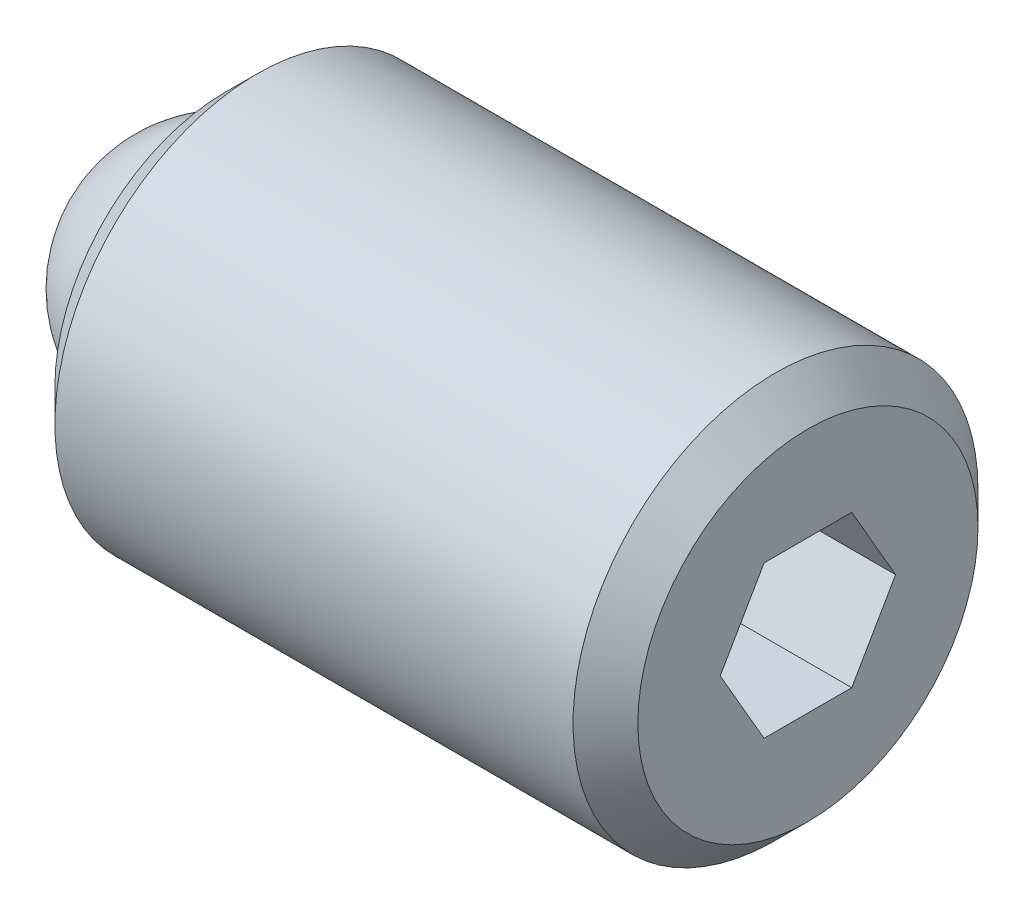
ISO-10303-21;
HEADER;
FILE_DESCRIPTION(('STEP AP214'),'2;1');
FILE_NAME('part.step','',(''),(''),'','','');
FILE_SCHEMA(('AUTOMOTIVE_DESIGN { 1 0 10303 214 1 1 1 1 }'));
ENDSEC;
DATA;
#1=APPLICATION_CONTEXT('core data for automotive mechanical design processes');
#2=APPLICATION_PROTOCOL_DEFINITION('international standard','automotive_design',2000,#1);
#3=PRODUCT_CONTEXT('',#1,'mechanical');
#4=PRODUCT('Part','Part','',(#3));
#5=PRODUCT_RELATED_PRODUCT_CATEGORY('part','',(#4));
#6=PRODUCT_DEFINITION_FORMATION('','',#4);
#7=PRODUCT_DEFINITION_CONTEXT('part definition',#1,'design');
#8=PRODUCT_DEFINITION('design','',#6,#7);
#9=PRODUCT_DEFINITION_SHAPE('','',#8);
#10=(LENGTH_UNIT() NAMED_UNIT(*) SI_UNIT(.MILLI.,.METRE.));
#11=(NAMED_UNIT(*) PLANE_ANGLE_UNIT() SI_UNIT($,.RADIAN.));
#12=(NAMED_UNIT(*) SI_UNIT($,.STERADIAN.) SOLID_ANGLE_UNIT());
#13=UNCERTAINTY_MEASURE_WITH_UNIT(LENGTH_MEASURE(1.E-05),#10,'distance_accuracy_value','');
#14=(GEOMETRIC_REPRESENTATION_CONTEXT(3) GLOBAL_UNCERTAINTY_ASSIGNED_CONTEXT((#13)) GLOBAL_UNIT_ASSIGNED_CONTEXT((#10,
#11,#12)) REPRESENTATION_CONTEXT('',''));
#15=CARTESIAN_POINT('',(0.,0.,0.));
#16=DIRECTION('',(0.,0.,1.));
#17=DIRECTION('',(1.,0.,0.));
#18=AXIS2_PLACEMENT_3D('',#15,#16,#17);
#19=CARTESIAN_POINT('',(0.,0.,0.));
#20=DIRECTION('',(0.,-1.,0.));
#21=DIRECTION('',(0.,0.,1.));
#22=AXIS2_PLACEMENT_3D('',#19,#20,#21);
#23=SPHERICAL_SURFACE('',#22,1.984375);
#24=CARTESIAN_POINT('',(0.,-1.984375,0.));
#25=VERTEX_POINT('',#24);
#26=VERTEX_LOOP('',#25);
#27=FACE_BOUND('',#26,.T.);
#28=ADVANCED_FACE('F43',(#27),#23,.T.);
#29=CLOSED_SHELL('',(#28));
#30=MANIFOLD_SOLID_BREP('B2',#29);
#31=CARTESIAN_POINT('',(9.140825,0.,0.));
#32=DIRECTION('',(-1.,0.,0.));
#33=DIRECTION('',(0.,0.,1.));
#34=AXIS2_PLACEMENT_3D('',#31,#32,#33);
#35=CYLINDRICAL_SURFACE('',#34,3.175);
#36=CARTESIAN_POINT('',(8.632825,0.,0.));
#37=DIRECTION('',(1.,0.,0.));
#38=DIRECTION('',(0.,0.,-1.));
#39=AXIS2_PLACEMENT_3D('',#36,#37,#38);
#40=CIRCLE('',#39,3.175);
#41=CARTESIAN_POINT('',(8.632825,0.,-3.175));
#42=VERTEX_POINT('',#41);
#43=EDGE_CURVE('E41',#42,#42,#40,.F.);
#44=ORIENTED_EDGE('',*,*,#43,.T.);
#45=EDGE_LOOP('',(#44));
#46=FACE_BOUND('',#45,.T.);
#47=CARTESIAN_POINT('',(0.507999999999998,0.,0.));
#48=DIRECTION('',(1.,0.,0.));
#49=DIRECTION('',(0.,0.,-1.));
#50=AXIS2_PLACEMENT_3D('',#47,#48,#49);
#51=CIRCLE('',#50,3.175);
#52=CARTESIAN_POINT('',(0.507999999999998,0.,-3.175));
#53=VERTEX_POINT('',#52);
#54=EDGE_CURVE('E159',#53,#53,#51,.T.);
#55=ORIENTED_EDGE('',*,*,#54,.T.);
#56=EDGE_LOOP('',(#55));
#57=FACE_BOUND('',#56,.T.);
#58=ADVANCED_FACE('F56',(#46,#57),#35,.T.);
#59=CARTESIAN_POINT('',(9.140825,0.,0.));
#60=DIRECTION('',(1.,0.,0.));
#61=DIRECTION('',(0.,0.,-1.));
#62=AXIS2_PLACEMENT_3D('',#59,#60,#61);
#63=PLANE('',#62);
#64=DIRECTION('',(0.,0.866025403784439,-0.5));
#65=VECTOR('',#64,1.);
#66=CARTESIAN_POINT('',(9.140825,-1.190625,-0.687407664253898));
#67=LINE('',#66,#65);
#68=CARTESIAN_POINT('',(9.140825,-1.190625,-0.687407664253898));
#69=VERTEX_POINT('',#68);
#70=CARTESIAN_POINT('',(9.140825,0.,-1.3748153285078));
#71=VERTEX_POINT('',#70);
#72=EDGE_CURVE('E71',#69,#71,#67,.T.);
#73=ORIENTED_EDGE('',*,*,#72,.F.);
#74=DIRECTION('',(0.,0.,-1.));
#75=VECTOR('',#74,1.);
#76=CARTESIAN_POINT('',(9.140825,-1.190625,0.687407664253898));
#77=LINE('',#76,#75);
#78=CARTESIAN_POINT('',(9.140825,-1.190625,0.687407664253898));
#79=VERTEX_POINT('',#78);
#80=EDGE_CURVE('E155',#79,#69,#77,.T.);
#81=ORIENTED_EDGE('',*,*,#80,.F.);
#82=DIRECTION('',(0.,-0.866025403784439,-0.5));
#83=VECTOR('',#82,1.);
#84=CARTESIAN_POINT('',(9.140825,0.,1.3748153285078));
#85=LINE('',#84,#83);
#86=CARTESIAN_POINT('',(9.140825,0.,1.3748153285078));
#87=VERTEX_POINT('',#86);
#88=EDGE_CURVE('E153',#87,#79,#85,.T.);
#89=ORIENTED_EDGE('',*,*,#88,.F.);
#90=DIRECTION('',(0.,-0.866025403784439,0.5));
#91=VECTOR('',#90,1.);
#92=CARTESIAN_POINT('',(9.140825,1.190625,0.687407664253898));
#93=LINE('',#92,#91);
#94=CARTESIAN_POINT('',(9.140825,1.190625,0.687407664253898));
#95=VERTEX_POINT('',#94);
#96=EDGE_CURVE('E119',#95,#87,#93,.T.);
#97=ORIENTED_EDGE('',*,*,#96,.F.);
#98=DIRECTION('',(0.,0.,1.));
#99=VECTOR('',#98,1.);
#100=CARTESIAN_POINT('',(9.140825,1.190625,-0.687407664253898));
#101=LINE('',#100,#99);
#102=CARTESIAN_POINT('',(9.140825,1.190625,-0.687407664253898));
#103=VERTEX_POINT('',#102);
#104=EDGE_CURVE('E149',#103,#95,#101,.T.);
#105=ORIENTED_EDGE('',*,*,#104,.F.);
#106=DIRECTION('',(0.,0.866025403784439,0.5));
#107=VECTOR('',#106,1.);
#108=CARTESIAN_POINT('',(9.140825,0.,-1.3748153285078));
#109=LINE('',#108,#107);
#110=EDGE_CURVE('E145',#71,#103,#109,.T.);
#111=ORIENTED_EDGE('',*,*,#110,.F.);
#112=EDGE_LOOP('',(#73,#81,#89,#97,#105,#111));
#113=FACE_BOUND('',#112,.T.);
#114=CARTESIAN_POINT('',(9.140825,0.,0.));
#115=DIRECTION('',(1.,0.,0.));
#116=DIRECTION('',(0.,0.,-1.));
#117=AXIS2_PLACEMENT_3D('',#114,#115,#116);
#118=CIRCLE('',#117,2.667);
#119=CARTESIAN_POINT('',(9.140825,0.,-2.667));
#120=VERTEX_POINT('',#119);
#121=EDGE_CURVE('E64',#120,#120,#118,.T.);
#122=ORIENTED_EDGE('',*,*,#121,.T.);
#123=EDGE_LOOP('',(#122));
#124=FACE_BOUND('',#123,.T.);
#125=ADVANCED_FACE('F172',(#113,#124),#63,.T.);
#126=CARTESIAN_POINT('',(0.,0.,0.));
#127=DIRECTION('',(1.,0.,0.));
#128=DIRECTION('',(0.,0.,-1.));
#129=AXIS2_PLACEMENT_3D('',#126,#127,#128);
#130=PLANE('',#129);
#131=CARTESIAN_POINT('',(0.,0.,0.));
#132=DIRECTION('',(-1.,0.,0.));
#133=DIRECTION('',(0.,0.,1.));
#134=AXIS2_PLACEMENT_3D('',#131,#132,#133);
#135=CIRCLE('',#134,1.9812);
#136=CARTESIAN_POINT('',(0.,0.,1.9812));
#137=VERTEX_POINT('',#136);
#138=EDGE_CURVE('E227',#137,#137,#135,.T.);
#139=ORIENTED_EDGE('',*,*,#138,.F.);
#140=EDGE_LOOP('',(#139));
#141=FACE_BOUND('',#140,.T.);
#142=CARTESIAN_POINT('',(0.,0.,0.));
#143=DIRECTION('',(1.,0.,0.));
#144=DIRECTION('',(0.,0.,-1.));
#145=AXIS2_PLACEMENT_3D('',#142,#143,#144);
#146=CIRCLE('',#145,2.667);
#147=CARTESIAN_POINT('',(0.,0.,-2.667));
#148=VERTEX_POINT('',#147);
#149=EDGE_CURVE('E167',#148,#148,#146,.F.);
#150=ORIENTED_EDGE('',*,*,#149,.T.);
#151=EDGE_LOOP('',(#150));
#152=FACE_BOUND('',#151,.T.);
#153=ADVANCED_FACE('F184',(#141,#152),#130,.F.);
#154=CARTESIAN_POINT('',(0.507999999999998,0.,0.));
#155=DIRECTION('',(1.,0.,0.));
#156=DIRECTION('',(0.,0.,-1.));
#157=AXIS2_PLACEMENT_3D('',#154,#155,#156);
#158=CONICAL_SURFACE('',#157,3.175,0.78539816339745);
#159=ORIENTED_EDGE('',*,*,#149,.F.);
#160=EDGE_LOOP('',(#159));
#161=FACE_BOUND('',#160,.T.);
#162=ORIENTED_EDGE('',*,*,#54,.F.);
#163=EDGE_LOOP('',(#162));
#164=FACE_BOUND('',#163,.T.);
#165=ADVANCED_FACE('F176',(#161,#164),#158,.T.);
#166=CARTESIAN_POINT('',(9.140825,0.,0.));
#167=DIRECTION('',(-1.,0.,0.));
#168=DIRECTION('',(0.,0.,1.));
#169=AXIS2_PLACEMENT_3D('',#166,#167,#168);
#170=CONICAL_SURFACE('',#169,2.667,0.785398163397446);
#171=ORIENTED_EDGE('',*,*,#43,.F.);
#172=EDGE_LOOP('',(#171));
#173=FACE_BOUND('',#172,.T.);
#174=ORIENTED_EDGE('',*,*,#121,.F.);
#175=EDGE_LOOP('',(#174));
#176=FACE_BOUND('',#175,.T.);
#177=ADVANCED_FACE('F58',(#173,#176),#170,.T.);
#178=CARTESIAN_POINT('',(6.854825,-1.190625,-0.687407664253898));
#179=DIRECTION('',(0.,-0.5,-0.866025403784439));
#180=DIRECTION('',(0.,0.866025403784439,-0.5));
#181=AXIS2_PLACEMENT_3D('',#178,#179,#180);
#182=PLANE('',#181);
#183=ORIENTED_EDGE('',*,*,#72,.T.);
#184=DIRECTION('',(1.,0.,0.));
#185=VECTOR('',#184,1.);
#186=CARTESIAN_POINT('',(6.854825,0.,-1.3748153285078));
#187=LINE('',#186,#185);
#188=CARTESIAN_POINT('',(6.854825,0.,-1.3748153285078));
#189=VERTEX_POINT('',#188);
#190=EDGE_CURVE('E101',#189,#71,#187,.T.);
#191=ORIENTED_EDGE('',*,*,#190,.F.);
#192=DIRECTION('',(0.,0.866025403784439,-0.5));
#193=VECTOR('',#192,1.);
#194=CARTESIAN_POINT('',(6.854825,-1.190625,-0.687407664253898));
#195=LINE('',#194,#193);
#196=CARTESIAN_POINT('',(6.854825,-1.190625,-0.687407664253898));
#197=VERTEX_POINT('',#196);
#198=EDGE_CURVE('E157',#197,#189,#195,.T.);
#199=ORIENTED_EDGE('',*,*,#198,.F.);
#200=DIRECTION('',(1.,0.,0.));
#201=VECTOR('',#200,1.);
#202=CARTESIAN_POINT('',(6.854825,-1.190625,-0.687407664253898));
#203=LINE('',#202,#201);
#204=EDGE_CURVE('E79',#197,#69,#203,.T.);
#205=ORIENTED_EDGE('',*,*,#204,.T.);
#206=EDGE_LOOP('',(#183,#191,#199,#205));
#207=FACE_BOUND('',#206,.T.);
#208=ADVANCED_FACE('F175',(#207),#182,.F.);
#209=CARTESIAN_POINT('',(6.854825,-1.190625,0.687407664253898));
#210=DIRECTION('',(0.,-1.,0.));
#211=DIRECTION('',(0.,0.,-1.));
#212=AXIS2_PLACEMENT_3D('',#209,#210,#211);
#213=PLANE('',#212);
#214=ORIENTED_EDGE('',*,*,#80,.T.);
#215=ORIENTED_EDGE('',*,*,#204,.F.);
#216=DIRECTION('',(0.,0.,-1.));
#217=VECTOR('',#216,1.);
#218=CARTESIAN_POINT('',(6.854825,-1.190625,0.687407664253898));
#219=LINE('',#218,#217);
#220=CARTESIAN_POINT('',(6.854825,-1.190625,0.687407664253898));
#221=VERTEX_POINT('',#220);
#222=EDGE_CURVE('E131',#221,#197,#219,.T.);
#223=ORIENTED_EDGE('',*,*,#222,.F.);
#224=DIRECTION('',(1.,0.,0.));
#225=VECTOR('',#224,1.);
#226=CARTESIAN_POINT('',(6.854825,-1.190625,0.687407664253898));
#227=LINE('',#226,#225);
#228=EDGE_CURVE('E123',#221,#79,#227,.T.);
#229=ORIENTED_EDGE('',*,*,#228,.T.);
#230=EDGE_LOOP('',(#214,#215,#223,#229));
#231=FACE_BOUND('',#230,.T.);
#232=ADVANCED_FACE('F182',(#231),#213,.F.);
#233=CARTESIAN_POINT('',(6.854825,0.,1.3748153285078));
#234=DIRECTION('',(0.,-0.5,0.866025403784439));
#235=DIRECTION('',(0.,-0.866025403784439,-0.5));
#236=AXIS2_PLACEMENT_3D('',#233,#234,#235);
#237=PLANE('',#236);
#238=ORIENTED_EDGE('',*,*,#88,.T.);
#239=ORIENTED_EDGE('',*,*,#228,.F.);
#240=DIRECTION('',(0.,-0.866025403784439,-0.5));
#241=VECTOR('',#240,1.);
#242=CARTESIAN_POINT('',(6.854825,0.,1.3748153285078));
#243=LINE('',#242,#241);
#244=CARTESIAN_POINT('',(6.854825,0.,1.3748153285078));
#245=VERTEX_POINT('',#244);
#246=EDGE_CURVE('E127',#245,#221,#243,.T.);
#247=ORIENTED_EDGE('',*,*,#246,.F.);
#248=DIRECTION('',(1.,0.,0.));
#249=VECTOR('',#248,1.);
#250=CARTESIAN_POINT('',(6.854825,0.,1.3748153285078));
#251=LINE('',#250,#249);
#252=EDGE_CURVE('E112',#245,#87,#251,.T.);
#253=ORIENTED_EDGE('',*,*,#252,.T.);
#254=EDGE_LOOP('',(#238,#239,#247,#253));
#255=FACE_BOUND('',#254,.T.);
#256=ADVANCED_FACE('F128',(#255),#237,.F.);
#257=CARTESIAN_POINT('',(6.854825,1.190625,0.687407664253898));
#258=DIRECTION('',(0.,0.5,0.866025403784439));
#259=DIRECTION('',(0.,-0.866025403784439,0.5));
#260=AXIS2_PLACEMENT_3D('',#257,#258,#259);
#261=PLANE('',#260);
#262=ORIENTED_EDGE('',*,*,#96,.T.);
#263=ORIENTED_EDGE('',*,*,#252,.F.);
#264=DIRECTION('',(0.,-0.866025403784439,0.5));
#265=VECTOR('',#264,1.);
#266=CARTESIAN_POINT('',(6.854825,1.190625,0.687407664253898));
#267=LINE('',#266,#265);
#268=CARTESIAN_POINT('',(6.854825,1.190625,0.687407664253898));
#269=VERTEX_POINT('',#268);
#270=EDGE_CURVE('E116',#269,#245,#267,.T.);
#271=ORIENTED_EDGE('',*,*,#270,.F.);
#272=DIRECTION('',(1.,0.,0.));
#273=VECTOR('',#272,1.);
#274=CARTESIAN_POINT('',(6.854825,1.190625,0.687407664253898));
#275=LINE('',#274,#273);
#276=EDGE_CURVE('E124',#269,#95,#275,.T.);
#277=ORIENTED_EDGE('',*,*,#276,.T.);
#278=EDGE_LOOP('',(#262,#263,#271,#277));
#279=FACE_BOUND('',#278,.T.);
#280=ADVANCED_FACE('F114',(#279),#261,.F.);
#281=CARTESIAN_POINT('',(6.854825,1.190625,-0.687407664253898));
#282=DIRECTION('',(0.,1.,0.));
#283=DIRECTION('',(0.,0.,1.));
#284=AXIS2_PLACEMENT_3D('',#281,#282,#283);
#285=PLANE('',#284);
#286=ORIENTED_EDGE('',*,*,#104,.T.);
#287=ORIENTED_EDGE('',*,*,#276,.F.);
#288=DIRECTION('',(0.,0.,1.));
#289=VECTOR('',#288,1.);
#290=CARTESIAN_POINT('',(6.854825,1.190625,-0.687407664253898));
#291=LINE('',#290,#289);
#292=CARTESIAN_POINT('',(6.854825,1.190625,-0.687407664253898));
#293=VERTEX_POINT('',#292);
#294=EDGE_CURVE('E137',#293,#269,#291,.T.);
#295=ORIENTED_EDGE('',*,*,#294,.F.);
#296=DIRECTION('',(1.,0.,0.));
#297=VECTOR('',#296,1.);
#298=CARTESIAN_POINT('',(6.854825,1.190625,-0.687407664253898));
#299=LINE('',#298,#297);
#300=EDGE_CURVE('E162',#293,#103,#299,.T.);
#301=ORIENTED_EDGE('',*,*,#300,.T.);
#302=EDGE_LOOP('',(#286,#287,#295,#301));
#303=FACE_BOUND('',#302,.T.);
#304=ADVANCED_FACE('F203',(#303),#285,.F.);
#305=CARTESIAN_POINT('',(6.854825,0.,-1.3748153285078));
#306=DIRECTION('',(0.,0.5,-0.866025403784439));
#307=DIRECTION('',(0.,0.866025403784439,0.5));
#308=AXIS2_PLACEMENT_3D('',#305,#306,#307);
#309=PLANE('',#308);
#310=ORIENTED_EDGE('',*,*,#110,.T.);
#311=ORIENTED_EDGE('',*,*,#300,.F.);
#312=DIRECTION('',(0.,0.866025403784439,0.5));
#313=VECTOR('',#312,1.);
#314=CARTESIAN_POINT('',(6.854825,0.,-1.3748153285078));
#315=LINE('',#314,#313);
#316=EDGE_CURVE('E139',#189,#293,#315,.T.);
#317=ORIENTED_EDGE('',*,*,#316,.F.);
#318=ORIENTED_EDGE('',*,*,#190,.T.);
#319=EDGE_LOOP('',(#310,#311,#317,#318));
#320=FACE_BOUND('',#319,.T.);
#321=ADVANCED_FACE('F200',(#320),#309,.F.);
#322=CARTESIAN_POINT('',(6.854825,0.,0.));
#323=DIRECTION('',(1.,0.,0.));
#324=DIRECTION('',(0.,0.,-1.));
#325=AXIS2_PLACEMENT_3D('',#322,#323,#324);
#326=PLANE('',#325);
#327=ORIENTED_EDGE('',*,*,#198,.T.);
#328=ORIENTED_EDGE('',*,*,#316,.T.);
#329=ORIENTED_EDGE('',*,*,#294,.T.);
#330=ORIENTED_EDGE('',*,*,#270,.T.);
#331=ORIENTED_EDGE('',*,*,#246,.T.);
#332=ORIENTED_EDGE('',*,*,#222,.T.);
#333=EDGE_LOOP('',(#327,#328,#329,#330,#331,#332));
#334=FACE_BOUND('',#333,.T.);
#335=ADVANCED_FACE('F134',(#334),#326,.T.);
#336=CARTESIAN_POINT('',(1.984375,0.,0.));
#337=DIRECTION('',(-1.,0.,0.));
#338=DIRECTION('',(0.,0.,1.));
#339=AXIS2_PLACEMENT_3D('',#336,#337,#338);
#340=CYLINDRICAL_SURFACE('',#339,1.9812);
#341=CARTESIAN_POINT('',(1.984375,0.,0.));
#342=DIRECTION('',(-1.,0.,0.));
#343=DIRECTION('',(0.,0.,1.));
#344=AXIS2_PLACEMENT_3D('',#341,#342,#343);
#345=CIRCLE('',#344,1.9812);
#346=CARTESIAN_POINT('',(1.984375,0.,1.9812));
#347=VERTEX_POINT('',#346);
#348=EDGE_CURVE('E146',#347,#347,#345,.T.);
#349=ORIENTED_EDGE('',*,*,#348,.F.);
#350=EDGE_LOOP('',(#349));
#351=FACE_BOUND('',#350,.T.);
#352=ORIENTED_EDGE('',*,*,#138,.T.);
#353=EDGE_LOOP('',(#352));
#354=FACE_BOUND('',#353,.T.);
#355=ADVANCED_FACE('F216',(#351,#354),#340,.F.);
#356=CARTESIAN_POINT('',(1.984375,0.,0.));
#357=DIRECTION('',(-1.,0.,0.));
#358=DIRECTION('',(0.,0.,1.));
#359=AXIS2_PLACEMENT_3D('',#356,#357,#358);
#360=PLANE('',#359);
#361=ORIENTED_EDGE('',*,*,#348,.T.);
#362=EDGE_LOOP('',(#361));
#363=FACE_BOUND('',#362,.T.);
#364=ADVANCED_FACE('F219',(#363),#360,.T.);
#365=CLOSED_SHELL('',(#58,#125,#153,#165,#177,#208,#232,#256,#280,#304,#321,#335,#355,#364));
#366=MANIFOLD_SOLID_BREP('B6',#365);
#367=ADVANCED_BREP_SHAPE_REPRESENTATION('',(#18,#30,#366),#14);
#368=SHAPE_DEFINITION_REPRESENTATION(#9,#367);
ENDSEC;
END-ISO-10303-21;
